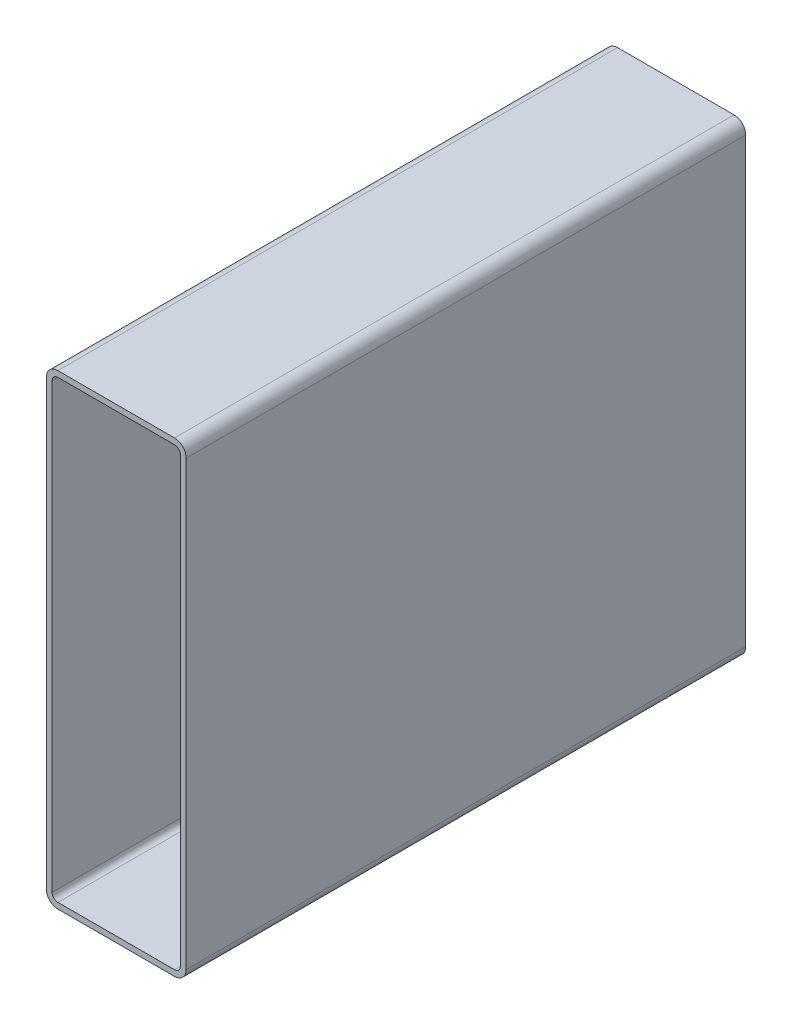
ISO-10303-21;
HEADER;
FILE_DESCRIPTION(('STEP AP214'),'2;1');
FILE_NAME('part.step','',(''),(''),'','','');
FILE_SCHEMA(('AUTOMOTIVE_DESIGN { 1 0 10303 214 1 1 1 1 }'));
ENDSEC;
DATA;
#1=APPLICATION_CONTEXT('core data for automotive mechanical design processes');
#2=APPLICATION_PROTOCOL_DEFINITION('international standard','automotive_design',2000,#1);
#3=PRODUCT_CONTEXT('',#1,'mechanical');
#4=PRODUCT('Part','Part','',(#3));
#5=PRODUCT_RELATED_PRODUCT_CATEGORY('part','',(#4));
#6=PRODUCT_DEFINITION_FORMATION('','',#4);
#7=PRODUCT_DEFINITION_CONTEXT('part definition',#1,'design');
#8=PRODUCT_DEFINITION('design','',#6,#7);
#9=PRODUCT_DEFINITION_SHAPE('','',#8);
#10=(LENGTH_UNIT() NAMED_UNIT(*) SI_UNIT(.MILLI.,.METRE.));
#11=(NAMED_UNIT(*) PLANE_ANGLE_UNIT() SI_UNIT($,.RADIAN.));
#12=(NAMED_UNIT(*) SI_UNIT($,.STERADIAN.) SOLID_ANGLE_UNIT());
#13=UNCERTAINTY_MEASURE_WITH_UNIT(LENGTH_MEASURE(1.E-05),#10,'distance_accuracy_value','');
#14=(GEOMETRIC_REPRESENTATION_CONTEXT(3) GLOBAL_UNCERTAINTY_ASSIGNED_CONTEXT((#13)) GLOBAL_UNIT_ASSIGNED_CONTEXT((#10,
#11,#12)) REPRESENTATION_CONTEXT('',''));
#15=CARTESIAN_POINT('',(0.,0.,0.));
#16=DIRECTION('',(0.,0.,1.));
#17=DIRECTION('',(1.,0.,0.));
#18=AXIS2_PLACEMENT_3D('',#15,#16,#17);
#19=CARTESIAN_POINT('',(8.83911603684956,249.570313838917,304.8));
#20=DIRECTION('',(0.,0.,1.));
#21=DIRECTION('',(1.,0.,0.));
#22=AXIS2_PLACEMENT_3D('',#19,#20,#21);
#23=PLANE('',#22);
#24=CARTESIAN_POINT('',(8.83911603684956,249.570313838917,304.8));
#25=DIRECTION('',(0.,0.,1.));
#26=DIRECTION('',(1.,0.,0.));
#27=AXIS2_PLACEMENT_3D('',#24,#25,#26);
#28=CIRCLE('',#27,6.35000000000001);
#29=CARTESIAN_POINT('',(8.83911603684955,255.920313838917,304.8));
#30=VERTEX_POINT('',#29);
#31=CARTESIAN_POINT('',(2.48911603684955,249.570313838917,304.8));
#32=VERTEX_POINT('',#31);
#33=EDGE_CURVE('E211',#30,#32,#28,.T.);
#34=ORIENTED_EDGE('',*,*,#33,.T.);
#35=DIRECTION('',(0.,-1.,0.));
#36=VECTOR('',#35,1.);
#37=CARTESIAN_POINT('',(2.48911603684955,8.27031383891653,304.8));
#38=LINE('',#37,#36);
#39=CARTESIAN_POINT('',(2.48911603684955,8.27031383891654,304.8));
#40=VERTEX_POINT('',#39);
#41=EDGE_CURVE('E214',#32,#40,#38,.T.);
#42=ORIENTED_EDGE('',*,*,#41,.T.);
#43=CARTESIAN_POINT('',(8.83911603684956,8.27031383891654,304.8));
#44=DIRECTION('',(0.,0.,1.));
#45=DIRECTION('',(1.,0.,0.));
#46=AXIS2_PLACEMENT_3D('',#43,#44,#45);
#47=CIRCLE('',#46,6.35);
#48=CARTESIAN_POINT('',(8.83911603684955,1.92031383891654,304.8));
#49=VERTEX_POINT('',#48);
#50=EDGE_CURVE('E217',#40,#49,#47,.T.);
#51=ORIENTED_EDGE('',*,*,#50,.T.);
#52=DIRECTION('',(1.,0.,0.));
#53=VECTOR('',#52,1.);
#54=CARTESIAN_POINT('',(72.3391160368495,1.92031383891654,304.8));
#55=LINE('',#54,#53);
#56=CARTESIAN_POINT('',(72.3391160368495,1.92031383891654,304.8));
#57=VERTEX_POINT('',#56);
#58=EDGE_CURVE('E219',#49,#57,#55,.T.);
#59=ORIENTED_EDGE('',*,*,#58,.T.);
#60=CARTESIAN_POINT('',(72.3391160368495,8.27031383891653,304.8));
#61=DIRECTION('',(0.,0.,1.));
#62=DIRECTION('',(1.,0.,0.));
#63=AXIS2_PLACEMENT_3D('',#60,#61,#62);
#64=CIRCLE('',#63,6.35);
#65=CARTESIAN_POINT('',(78.6891160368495,8.27031383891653,304.8));
#66=VERTEX_POINT('',#65);
#67=EDGE_CURVE('E221',#57,#66,#64,.T.);
#68=ORIENTED_EDGE('',*,*,#67,.T.);
#69=DIRECTION('',(0.,1.,0.));
#70=VECTOR('',#69,1.);
#71=CARTESIAN_POINT('',(78.6891160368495,249.570313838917,304.8));
#72=LINE('',#71,#70);
#73=CARTESIAN_POINT('',(78.6891160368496,249.570313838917,304.8));
#74=VERTEX_POINT('',#73);
#75=EDGE_CURVE('E223',#66,#74,#72,.T.);
#76=ORIENTED_EDGE('',*,*,#75,.T.);
#77=CARTESIAN_POINT('',(72.3391160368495,249.570313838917,304.8));
#78=DIRECTION('',(0.,0.,1.));
#79=DIRECTION('',(1.,0.,0.));
#80=AXIS2_PLACEMENT_3D('',#77,#78,#79);
#81=CIRCLE('',#80,6.35000000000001);
#82=CARTESIAN_POINT('',(72.3391160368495,255.920313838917,304.8));
#83=VERTEX_POINT('',#82);
#84=EDGE_CURVE('E225',#74,#83,#81,.T.);
#85=ORIENTED_EDGE('',*,*,#84,.T.);
#86=DIRECTION('',(-1.,0.,0.));
#87=VECTOR('',#86,1.);
#88=CARTESIAN_POINT('',(8.83911603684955,255.920313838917,304.8));
#89=LINE('',#88,#87);
#90=EDGE_CURVE('E227',#83,#30,#89,.T.);
#91=ORIENTED_EDGE('',*,*,#90,.T.);
#92=EDGE_LOOP('',(#34,#42,#51,#59,#68,#76,#85,#91));
#93=FACE_BOUND('',#92,.T.);
#94=DIRECTION('',(0.,-1.,0.));
#95=VECTOR('',#94,1.);
#96=CARTESIAN_POINT('',(5.66411603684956,8.27031383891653,304.8));
#97=LINE('',#96,#95);
#98=CARTESIAN_POINT('',(5.66411603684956,249.570313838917,304.8));
#99=VERTEX_POINT('',#98);
#100=CARTESIAN_POINT('',(5.66411603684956,8.27031383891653,304.8));
#101=VERTEX_POINT('',#100);
#102=EDGE_CURVE('E154',#99,#101,#97,.T.);
#103=ORIENTED_EDGE('',*,*,#102,.F.);
#104=CARTESIAN_POINT('',(8.83911603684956,249.570313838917,304.8));
#105=DIRECTION('',(0.,0.,1.));
#106=DIRECTION('',(1.,0.,0.));
#107=AXIS2_PLACEMENT_3D('',#104,#105,#106);
#108=CIRCLE('',#107,3.17499999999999);
#109=CARTESIAN_POINT('',(8.83911603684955,252.745313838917,304.8));
#110=VERTEX_POINT('',#109);
#111=EDGE_CURVE('E146',#110,#99,#108,.T.);
#112=ORIENTED_EDGE('',*,*,#111,.F.);
#113=DIRECTION('',(-1.,0.,0.));
#114=VECTOR('',#113,1.);
#115=CARTESIAN_POINT('',(8.83911603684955,252.745313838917,304.8));
#116=LINE('',#115,#114);
#117=CARTESIAN_POINT('',(72.3391160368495,252.745313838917,304.8));
#118=VERTEX_POINT('',#117);
#119=EDGE_CURVE('E179',#118,#110,#116,.T.);
#120=ORIENTED_EDGE('',*,*,#119,.F.);
#121=CARTESIAN_POINT('',(72.3391160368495,249.570313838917,304.8));
#122=DIRECTION('',(0.,0.,1.));
#123=DIRECTION('',(1.,0.,0.));
#124=AXIS2_PLACEMENT_3D('',#121,#122,#123);
#125=CIRCLE('',#124,3.175);
#126=CARTESIAN_POINT('',(75.5141160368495,249.570313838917,304.8));
#127=VERTEX_POINT('',#126);
#128=EDGE_CURVE('E177',#127,#118,#125,.T.);
#129=ORIENTED_EDGE('',*,*,#128,.F.);
#130=DIRECTION('',(0.,1.,0.));
#131=VECTOR('',#130,1.);
#132=CARTESIAN_POINT('',(75.5141160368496,249.570313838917,304.8));
#133=LINE('',#132,#131);
#134=CARTESIAN_POINT('',(75.5141160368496,8.27031383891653,304.8));
#135=VERTEX_POINT('',#134);
#136=EDGE_CURVE('E175',#135,#127,#133,.T.);
#137=ORIENTED_EDGE('',*,*,#136,.F.);
#138=CARTESIAN_POINT('',(72.3391160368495,8.27031383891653,304.8));
#139=DIRECTION('',(0.,0.,1.));
#140=DIRECTION('',(1.,0.,0.));
#141=AXIS2_PLACEMENT_3D('',#138,#139,#140);
#142=CIRCLE('',#141,3.175);
#143=CARTESIAN_POINT('',(72.3391160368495,5.09531383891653,304.8));
#144=VERTEX_POINT('',#143);
#145=EDGE_CURVE('E173',#144,#135,#142,.T.);
#146=ORIENTED_EDGE('',*,*,#145,.F.);
#147=DIRECTION('',(1.,0.,0.));
#148=VECTOR('',#147,1.);
#149=CARTESIAN_POINT('',(72.3391160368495,5.09531383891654,304.8));
#150=LINE('',#149,#148);
#151=CARTESIAN_POINT('',(8.83911603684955,5.09531383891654,304.8));
#152=VERTEX_POINT('',#151);
#153=EDGE_CURVE('E169',#152,#144,#150,.T.);
#154=ORIENTED_EDGE('',*,*,#153,.F.);
#155=CARTESIAN_POINT('',(8.83911603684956,8.27031383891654,304.8));
#156=DIRECTION('',(0.,0.,1.));
#157=DIRECTION('',(1.,0.,0.));
#158=AXIS2_PLACEMENT_3D('',#155,#156,#157);
#159=CIRCLE('',#158,3.175);
#160=EDGE_CURVE('E167',#101,#152,#159,.T.);
#161=ORIENTED_EDGE('',*,*,#160,.F.);
#162=EDGE_LOOP('',(#103,#112,#120,#129,#137,#146,#154,#161));
#163=FACE_BOUND('',#162,.T.);
#164=ADVANCED_FACE('F33',(#93,#163),#23,.T.);
#165=CARTESIAN_POINT('',(8.83911603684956,249.570313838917,0.));
#166=DIRECTION('',(0.,0.,1.));
#167=DIRECTION('',(1.,0.,0.));
#168=AXIS2_PLACEMENT_3D('',#165,#166,#167);
#169=PLANE('',#168);
#170=CARTESIAN_POINT('',(8.83911603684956,249.570313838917,0.));
#171=DIRECTION('',(0.,0.,1.));
#172=DIRECTION('',(1.,0.,0.));
#173=AXIS2_PLACEMENT_3D('',#170,#171,#172);
#174=CIRCLE('',#173,6.35000000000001);
#175=CARTESIAN_POINT('',(8.83911603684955,255.920313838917,0.));
#176=VERTEX_POINT('',#175);
#177=CARTESIAN_POINT('',(2.48911603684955,249.570313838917,0.));
#178=VERTEX_POINT('',#177);
#179=EDGE_CURVE('E162',#176,#178,#174,.T.);
#180=ORIENTED_EDGE('',*,*,#179,.F.);
#181=DIRECTION('',(-1.,0.,0.));
#182=VECTOR('',#181,1.);
#183=CARTESIAN_POINT('',(8.83911603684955,255.920313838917,0.));
#184=LINE('',#183,#182);
#185=CARTESIAN_POINT('',(72.3391160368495,255.920313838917,0.));
#186=VERTEX_POINT('',#185);
#187=EDGE_CURVE('E215',#186,#176,#184,.T.);
#188=ORIENTED_EDGE('',*,*,#187,.F.);
#189=CARTESIAN_POINT('',(72.3391160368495,249.570313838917,0.));
#190=DIRECTION('',(0.,0.,1.));
#191=DIRECTION('',(1.,0.,0.));
#192=AXIS2_PLACEMENT_3D('',#189,#190,#191);
#193=CIRCLE('',#192,6.35000000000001);
#194=CARTESIAN_POINT('',(78.6891160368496,249.570313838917,0.));
#195=VERTEX_POINT('',#194);
#196=EDGE_CURVE('E242',#195,#186,#193,.T.);
#197=ORIENTED_EDGE('',*,*,#196,.F.);
#198=DIRECTION('',(0.,1.,0.));
#199=VECTOR('',#198,1.);
#200=CARTESIAN_POINT('',(78.6891160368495,249.570313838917,0.));
#201=LINE('',#200,#199);
#202=CARTESIAN_POINT('',(78.6891160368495,8.27031383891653,0.));
#203=VERTEX_POINT('',#202);
#204=EDGE_CURVE('E240',#203,#195,#201,.T.);
#205=ORIENTED_EDGE('',*,*,#204,.F.);
#206=CARTESIAN_POINT('',(72.3391160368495,8.27031383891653,0.));
#207=DIRECTION('',(0.,0.,1.));
#208=DIRECTION('',(1.,0.,0.));
#209=AXIS2_PLACEMENT_3D('',#206,#207,#208);
#210=CIRCLE('',#209,6.35);
#211=CARTESIAN_POINT('',(72.3391160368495,1.92031383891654,0.));
#212=VERTEX_POINT('',#211);
#213=EDGE_CURVE('E238',#212,#203,#210,.T.);
#214=ORIENTED_EDGE('',*,*,#213,.F.);
#215=DIRECTION('',(1.,0.,0.));
#216=VECTOR('',#215,1.);
#217=CARTESIAN_POINT('',(72.3391160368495,1.92031383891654,0.));
#218=LINE('',#217,#216);
#219=CARTESIAN_POINT('',(8.83911603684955,1.92031383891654,0.));
#220=VERTEX_POINT('',#219);
#221=EDGE_CURVE('E236',#220,#212,#218,.T.);
#222=ORIENTED_EDGE('',*,*,#221,.F.);
#223=CARTESIAN_POINT('',(8.83911603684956,8.27031383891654,0.));
#224=DIRECTION('',(0.,0.,1.));
#225=DIRECTION('',(1.,0.,0.));
#226=AXIS2_PLACEMENT_3D('',#223,#224,#225);
#227=CIRCLE('',#226,6.35);
#228=CARTESIAN_POINT('',(2.48911603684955,8.27031383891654,0.));
#229=VERTEX_POINT('',#228);
#230=EDGE_CURVE('E234',#229,#220,#227,.T.);
#231=ORIENTED_EDGE('',*,*,#230,.F.);
#232=DIRECTION('',(0.,-1.,0.));
#233=VECTOR('',#232,1.);
#234=CARTESIAN_POINT('',(2.48911603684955,8.27031383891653,0.));
#235=LINE('',#234,#233);
#236=EDGE_CURVE('E232',#178,#229,#235,.T.);
#237=ORIENTED_EDGE('',*,*,#236,.F.);
#238=EDGE_LOOP('',(#180,#188,#197,#205,#214,#222,#231,#237));
#239=FACE_BOUND('',#238,.T.);
#240=CARTESIAN_POINT('',(8.83911603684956,249.570313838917,0.));
#241=DIRECTION('',(0.,0.,1.));
#242=DIRECTION('',(1.,0.,0.));
#243=AXIS2_PLACEMENT_3D('',#240,#241,#242);
#244=CIRCLE('',#243,3.17499999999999);
#245=CARTESIAN_POINT('',(8.83911603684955,252.745313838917,0.));
#246=VERTEX_POINT('',#245);
#247=CARTESIAN_POINT('',(5.66411603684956,249.570313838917,0.));
#248=VERTEX_POINT('',#247);
#249=EDGE_CURVE('E56',#246,#248,#244,.T.);
#250=ORIENTED_EDGE('',*,*,#249,.T.);
#251=DIRECTION('',(0.,-1.,0.));
#252=VECTOR('',#251,1.);
#253=CARTESIAN_POINT('',(5.66411603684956,8.27031383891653,0.));
#254=LINE('',#253,#252);
#255=CARTESIAN_POINT('',(5.66411603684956,8.27031383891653,0.));
#256=VERTEX_POINT('',#255);
#257=EDGE_CURVE('E161',#248,#256,#254,.T.);
#258=ORIENTED_EDGE('',*,*,#257,.T.);
#259=CARTESIAN_POINT('',(8.83911603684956,8.27031383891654,0.));
#260=DIRECTION('',(0.,0.,1.));
#261=DIRECTION('',(1.,0.,0.));
#262=AXIS2_PLACEMENT_3D('',#259,#260,#261);
#263=CIRCLE('',#262,3.175);
#264=CARTESIAN_POINT('',(8.83911603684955,5.09531383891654,0.));
#265=VERTEX_POINT('',#264);
#266=EDGE_CURVE('E183',#256,#265,#263,.T.);
#267=ORIENTED_EDGE('',*,*,#266,.T.);
#268=DIRECTION('',(1.,0.,0.));
#269=VECTOR('',#268,1.);
#270=CARTESIAN_POINT('',(72.3391160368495,5.09531383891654,0.));
#271=LINE('',#270,#269);
#272=CARTESIAN_POINT('',(72.3391160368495,5.09531383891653,0.));
#273=VERTEX_POINT('',#272);
#274=EDGE_CURVE('E186',#265,#273,#271,.T.);
#275=ORIENTED_EDGE('',*,*,#274,.T.);
#276=CARTESIAN_POINT('',(72.3391160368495,8.27031383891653,0.));
#277=DIRECTION('',(0.,0.,1.));
#278=DIRECTION('',(1.,0.,0.));
#279=AXIS2_PLACEMENT_3D('',#276,#277,#278);
#280=CIRCLE('',#279,3.175);
#281=CARTESIAN_POINT('',(75.5141160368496,8.27031383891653,0.));
#282=VERTEX_POINT('',#281);
#283=EDGE_CURVE('E189',#273,#282,#280,.T.);
#284=ORIENTED_EDGE('',*,*,#283,.T.);
#285=DIRECTION('',(0.,1.,0.));
#286=VECTOR('',#285,1.);
#287=CARTESIAN_POINT('',(75.5141160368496,249.570313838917,0.));
#288=LINE('',#287,#286);
#289=CARTESIAN_POINT('',(75.5141160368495,249.570313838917,0.));
#290=VERTEX_POINT('',#289);
#291=EDGE_CURVE('E192',#282,#290,#288,.T.);
#292=ORIENTED_EDGE('',*,*,#291,.T.);
#293=CARTESIAN_POINT('',(72.3391160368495,249.570313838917,0.));
#294=DIRECTION('',(0.,0.,1.));
#295=DIRECTION('',(1.,0.,0.));
#296=AXIS2_PLACEMENT_3D('',#293,#294,#295);
#297=CIRCLE('',#296,3.175);
#298=CARTESIAN_POINT('',(72.3391160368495,252.745313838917,0.));
#299=VERTEX_POINT('',#298);
#300=EDGE_CURVE('E195',#290,#299,#297,.T.);
#301=ORIENTED_EDGE('',*,*,#300,.T.);
#302=DIRECTION('',(-1.,0.,0.));
#303=VECTOR('',#302,1.);
#304=CARTESIAN_POINT('',(8.83911603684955,252.745313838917,0.));
#305=LINE('',#304,#303);
#306=EDGE_CURVE('E155',#299,#246,#305,.T.);
#307=ORIENTED_EDGE('',*,*,#306,.T.);
#308=EDGE_LOOP('',(#250,#258,#267,#275,#284,#292,#301,#307));
#309=FACE_BOUND('',#308,.T.);
#310=ADVANCED_FACE('F272',(#239,#309),#169,.F.);
#311=CARTESIAN_POINT('',(8.83911603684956,249.570313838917,304.8));
#312=DIRECTION('',(0.,0.,-1.));
#313=DIRECTION('',(-1.,0.,0.));
#314=AXIS2_PLACEMENT_3D('',#311,#312,#313);
#315=CYLINDRICAL_SURFACE('',#314,6.35000000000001);
#316=ORIENTED_EDGE('',*,*,#179,.T.);
#317=DIRECTION('',(0.,0.,-1.));
#318=VECTOR('',#317,1.);
#319=CARTESIAN_POINT('',(2.48911603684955,249.570313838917,304.8));
#320=LINE('',#319,#318);
#321=EDGE_CURVE('E11',#32,#178,#320,.T.);
#322=ORIENTED_EDGE('',*,*,#321,.F.);
#323=ORIENTED_EDGE('',*,*,#33,.F.);
#324=DIRECTION('',(0.,0.,-1.));
#325=VECTOR('',#324,1.);
#326=CARTESIAN_POINT('',(8.83911603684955,255.920313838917,304.8));
#327=LINE('',#326,#325);
#328=EDGE_CURVE('E229',#30,#176,#327,.T.);
#329=ORIENTED_EDGE('',*,*,#328,.T.);
#330=EDGE_LOOP('',(#316,#322,#323,#329));
#331=FACE_BOUND('',#330,.T.);
#332=ADVANCED_FACE('F35',(#331),#315,.T.);
#333=CARTESIAN_POINT('',(2.48911603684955,8.27031383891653,304.8));
#334=DIRECTION('',(1.,0.,0.));
#335=DIRECTION('',(0.,0.,-1.));
#336=AXIS2_PLACEMENT_3D('',#333,#334,#335);
#337=PLANE('',#336);
#338=ORIENTED_EDGE('',*,*,#236,.T.);
#339=DIRECTION('',(0.,0.,-1.));
#340=VECTOR('',#339,1.);
#341=CARTESIAN_POINT('',(2.48911603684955,8.27031383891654,304.8));
#342=LINE('',#341,#340);
#343=EDGE_CURVE('E41',#40,#229,#342,.T.);
#344=ORIENTED_EDGE('',*,*,#343,.F.);
#345=ORIENTED_EDGE('',*,*,#41,.F.);
#346=ORIENTED_EDGE('',*,*,#321,.T.);
#347=EDGE_LOOP('',(#338,#344,#345,#346));
#348=FACE_BOUND('',#347,.T.);
#349=ADVANCED_FACE('F289',(#348),#337,.F.);
#350=CARTESIAN_POINT('',(8.83911603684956,8.27031383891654,304.8));
#351=DIRECTION('',(0.,0.,-1.));
#352=DIRECTION('',(-1.,0.,0.));
#353=AXIS2_PLACEMENT_3D('',#350,#351,#352);
#354=CYLINDRICAL_SURFACE('',#353,6.35);
#355=ORIENTED_EDGE('',*,*,#230,.T.);
#356=DIRECTION('',(0.,0.,-1.));
#357=VECTOR('',#356,1.);
#358=CARTESIAN_POINT('',(8.83911603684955,1.92031383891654,304.8));
#359=LINE('',#358,#357);
#360=EDGE_CURVE('E259',#49,#220,#359,.T.);
#361=ORIENTED_EDGE('',*,*,#360,.F.);
#362=ORIENTED_EDGE('',*,*,#50,.F.);
#363=ORIENTED_EDGE('',*,*,#343,.T.);
#364=EDGE_LOOP('',(#355,#361,#362,#363));
#365=FACE_BOUND('',#364,.T.);
#366=ADVANCED_FACE('F266',(#365),#354,.T.);
#367=CARTESIAN_POINT('',(72.3391160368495,1.92031383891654,304.8));
#368=DIRECTION('',(0.,1.,0.));
#369=DIRECTION('',(0.,0.,1.));
#370=AXIS2_PLACEMENT_3D('',#367,#368,#369);
#371=PLANE('',#370);
#372=ORIENTED_EDGE('',*,*,#221,.T.);
#373=DIRECTION('',(0.,0.,-1.));
#374=VECTOR('',#373,1.);
#375=CARTESIAN_POINT('',(72.3391160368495,1.92031383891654,304.8));
#376=LINE('',#375,#374);
#377=EDGE_CURVE('E256',#57,#212,#376,.T.);
#378=ORIENTED_EDGE('',*,*,#377,.F.);
#379=ORIENTED_EDGE('',*,*,#58,.F.);
#380=ORIENTED_EDGE('',*,*,#360,.T.);
#381=EDGE_LOOP('',(#372,#378,#379,#380));
#382=FACE_BOUND('',#381,.T.);
#383=ADVANCED_FACE('F278',(#382),#371,.F.);
#384=CARTESIAN_POINT('',(72.3391160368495,8.27031383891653,304.8));
#385=DIRECTION('',(0.,0.,-1.));
#386=DIRECTION('',(-1.,0.,0.));
#387=AXIS2_PLACEMENT_3D('',#384,#385,#386);
#388=CYLINDRICAL_SURFACE('',#387,6.35);
#389=ORIENTED_EDGE('',*,*,#213,.T.);
#390=DIRECTION('',(0.,0.,-1.));
#391=VECTOR('',#390,1.);
#392=CARTESIAN_POINT('',(78.6891160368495,8.27031383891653,304.8));
#393=LINE('',#392,#391);
#394=EDGE_CURVE('E253',#66,#203,#393,.T.);
#395=ORIENTED_EDGE('',*,*,#394,.F.);
#396=ORIENTED_EDGE('',*,*,#67,.F.);
#397=ORIENTED_EDGE('',*,*,#377,.T.);
#398=EDGE_LOOP('',(#389,#395,#396,#397));
#399=FACE_BOUND('',#398,.T.);
#400=ADVANCED_FACE('F282',(#399),#388,.T.);
#401=CARTESIAN_POINT('',(78.6891160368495,249.570313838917,304.8));
#402=DIRECTION('',(-1.,0.,0.));
#403=DIRECTION('',(0.,0.,1.));
#404=AXIS2_PLACEMENT_3D('',#401,#402,#403);
#405=PLANE('',#404);
#406=ORIENTED_EDGE('',*,*,#204,.T.);
#407=DIRECTION('',(0.,0.,-1.));
#408=VECTOR('',#407,1.);
#409=CARTESIAN_POINT('',(78.6891160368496,249.570313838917,304.8));
#410=LINE('',#409,#408);
#411=EDGE_CURVE('E250',#74,#195,#410,.T.);
#412=ORIENTED_EDGE('',*,*,#411,.F.);
#413=ORIENTED_EDGE('',*,*,#75,.F.);
#414=ORIENTED_EDGE('',*,*,#394,.T.);
#415=EDGE_LOOP('',(#406,#412,#413,#414));
#416=FACE_BOUND('',#415,.T.);
#417=ADVANCED_FACE('F302',(#416),#405,.F.);
#418=CARTESIAN_POINT('',(72.3391160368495,249.570313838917,304.8));
#419=DIRECTION('',(0.,0.,-1.));
#420=DIRECTION('',(-1.,0.,0.));
#421=AXIS2_PLACEMENT_3D('',#418,#419,#420);
#422=CYLINDRICAL_SURFACE('',#421,6.35000000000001);
#423=ORIENTED_EDGE('',*,*,#196,.T.);
#424=DIRECTION('',(0.,0.,-1.));
#425=VECTOR('',#424,1.);
#426=CARTESIAN_POINT('',(72.3391160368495,255.920313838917,304.8));
#427=LINE('',#426,#425);
#428=EDGE_CURVE('E247',#83,#186,#427,.T.);
#429=ORIENTED_EDGE('',*,*,#428,.F.);
#430=ORIENTED_EDGE('',*,*,#84,.F.);
#431=ORIENTED_EDGE('',*,*,#411,.T.);
#432=EDGE_LOOP('',(#423,#429,#430,#431));
#433=FACE_BOUND('',#432,.T.);
#434=ADVANCED_FACE('F300',(#433),#422,.T.);
#435=CARTESIAN_POINT('',(8.83911603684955,255.920313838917,304.8));
#436=DIRECTION('',(0.,-1.,0.));
#437=DIRECTION('',(0.,0.,-1.));
#438=AXIS2_PLACEMENT_3D('',#435,#436,#437);
#439=PLANE('',#438);
#440=ORIENTED_EDGE('',*,*,#187,.T.);
#441=ORIENTED_EDGE('',*,*,#328,.F.);
#442=ORIENTED_EDGE('',*,*,#90,.F.);
#443=ORIENTED_EDGE('',*,*,#428,.T.);
#444=EDGE_LOOP('',(#440,#441,#442,#443));
#445=FACE_BOUND('',#444,.T.);
#446=ADVANCED_FACE('F295',(#445),#439,.F.);
#447=CARTESIAN_POINT('',(8.83911603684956,249.570313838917,304.8));
#448=DIRECTION('',(0.,0.,-1.));
#449=DIRECTION('',(-1.,0.,0.));
#450=AXIS2_PLACEMENT_3D('',#447,#448,#449);
#451=CYLINDRICAL_SURFACE('',#450,3.17499999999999);
#452=ORIENTED_EDGE('',*,*,#249,.F.);
#453=DIRECTION('',(0.,0.,-1.));
#454=VECTOR('',#453,1.);
#455=CARTESIAN_POINT('',(8.83911603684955,252.745313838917,304.8));
#456=LINE('',#455,#454);
#457=EDGE_CURVE('E150',#110,#246,#456,.T.);
#458=ORIENTED_EDGE('',*,*,#457,.F.);
#459=ORIENTED_EDGE('',*,*,#111,.T.);
#460=DIRECTION('',(0.,0.,-1.));
#461=VECTOR('',#460,1.);
#462=CARTESIAN_POINT('',(5.66411603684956,249.570313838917,304.8));
#463=LINE('',#462,#461);
#464=EDGE_CURVE('E149',#99,#248,#463,.T.);
#465=ORIENTED_EDGE('',*,*,#464,.T.);
#466=EDGE_LOOP('',(#452,#458,#459,#465));
#467=FACE_BOUND('',#466,.T.);
#468=ADVANCED_FACE('F148',(#467),#451,.F.);
#469=CARTESIAN_POINT('',(5.66411603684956,8.27031383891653,304.8));
#470=DIRECTION('',(1.,0.,0.));
#471=DIRECTION('',(0.,0.,-1.));
#472=AXIS2_PLACEMENT_3D('',#469,#470,#471);
#473=PLANE('',#472);
#474=ORIENTED_EDGE('',*,*,#257,.F.);
#475=ORIENTED_EDGE('',*,*,#464,.F.);
#476=ORIENTED_EDGE('',*,*,#102,.T.);
#477=DIRECTION('',(0.,0.,-1.));
#478=VECTOR('',#477,1.);
#479=CARTESIAN_POINT('',(5.66411603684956,8.27031383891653,304.8));
#480=LINE('',#479,#478);
#481=EDGE_CURVE('E163',#101,#256,#480,.T.);
#482=ORIENTED_EDGE('',*,*,#481,.T.);
#483=EDGE_LOOP('',(#474,#475,#476,#482));
#484=FACE_BOUND('',#483,.T.);
#485=ADVANCED_FACE('F158',(#484),#473,.T.);
#486=CARTESIAN_POINT('',(8.83911603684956,8.27031383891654,304.8));
#487=DIRECTION('',(0.,0.,-1.));
#488=DIRECTION('',(-1.,0.,0.));
#489=AXIS2_PLACEMENT_3D('',#486,#487,#488);
#490=CYLINDRICAL_SURFACE('',#489,3.175);
#491=ORIENTED_EDGE('',*,*,#266,.F.);
#492=ORIENTED_EDGE('',*,*,#481,.F.);
#493=ORIENTED_EDGE('',*,*,#160,.T.);
#494=DIRECTION('',(0.,0.,-1.));
#495=VECTOR('',#494,1.);
#496=CARTESIAN_POINT('',(8.83911603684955,5.09531383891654,304.8));
#497=LINE('',#496,#495);
#498=EDGE_CURVE('E208',#152,#265,#497,.T.);
#499=ORIENTED_EDGE('',*,*,#498,.T.);
#500=EDGE_LOOP('',(#491,#492,#493,#499));
#501=FACE_BOUND('',#500,.T.);
#502=ADVANCED_FACE('F327',(#501),#490,.F.);
#503=CARTESIAN_POINT('',(72.3391160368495,5.09531383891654,304.8));
#504=DIRECTION('',(0.,1.,0.));
#505=DIRECTION('',(0.,0.,1.));
#506=AXIS2_PLACEMENT_3D('',#503,#504,#505);
#507=PLANE('',#506);
#508=ORIENTED_EDGE('',*,*,#274,.F.);
#509=ORIENTED_EDGE('',*,*,#498,.F.);
#510=ORIENTED_EDGE('',*,*,#153,.T.);
#511=DIRECTION('',(0.,0.,-1.));
#512=VECTOR('',#511,1.);
#513=CARTESIAN_POINT('',(72.3391160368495,5.09531383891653,304.8));
#514=LINE('',#513,#512);
#515=EDGE_CURVE('E206',#144,#273,#514,.T.);
#516=ORIENTED_EDGE('',*,*,#515,.T.);
#517=EDGE_LOOP('',(#508,#509,#510,#516));
#518=FACE_BOUND('',#517,.T.);
#519=ADVANCED_FACE('F331',(#518),#507,.T.);
#520=CARTESIAN_POINT('',(72.3391160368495,8.27031383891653,304.8));
#521=DIRECTION('',(0.,0.,-1.));
#522=DIRECTION('',(-1.,0.,0.));
#523=AXIS2_PLACEMENT_3D('',#520,#521,#522);
#524=CYLINDRICAL_SURFACE('',#523,3.175);
#525=ORIENTED_EDGE('',*,*,#283,.F.);
#526=ORIENTED_EDGE('',*,*,#515,.F.);
#527=ORIENTED_EDGE('',*,*,#145,.T.);
#528=DIRECTION('',(0.,0.,-1.));
#529=VECTOR('',#528,1.);
#530=CARTESIAN_POINT('',(75.5141160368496,8.27031383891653,304.8));
#531=LINE('',#530,#529);
#532=EDGE_CURVE('E204',#135,#282,#531,.T.);
#533=ORIENTED_EDGE('',*,*,#532,.T.);
#534=EDGE_LOOP('',(#525,#526,#527,#533));
#535=FACE_BOUND('',#534,.T.);
#536=ADVANCED_FACE('F337',(#535),#524,.F.);
#537=CARTESIAN_POINT('',(75.5141160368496,249.570313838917,304.8));
#538=DIRECTION('',(-1.,0.,0.));
#539=DIRECTION('',(0.,0.,1.));
#540=AXIS2_PLACEMENT_3D('',#537,#538,#539);
#541=PLANE('',#540);
#542=ORIENTED_EDGE('',*,*,#291,.F.);
#543=ORIENTED_EDGE('',*,*,#532,.F.);
#544=ORIENTED_EDGE('',*,*,#136,.T.);
#545=DIRECTION('',(0.,0.,-1.));
#546=VECTOR('',#545,1.);
#547=CARTESIAN_POINT('',(75.5141160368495,249.570313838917,304.8));
#548=LINE('',#547,#546);
#549=EDGE_CURVE('E202',#127,#290,#548,.T.);
#550=ORIENTED_EDGE('',*,*,#549,.T.);
#551=EDGE_LOOP('',(#542,#543,#544,#550));
#552=FACE_BOUND('',#551,.T.);
#553=ADVANCED_FACE('F341',(#552),#541,.T.);
#554=CARTESIAN_POINT('',(72.3391160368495,249.570313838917,304.8));
#555=DIRECTION('',(0.,0.,-1.));
#556=DIRECTION('',(-1.,0.,0.));
#557=AXIS2_PLACEMENT_3D('',#554,#555,#556);
#558=CYLINDRICAL_SURFACE('',#557,3.175);
#559=ORIENTED_EDGE('',*,*,#300,.F.);
#560=ORIENTED_EDGE('',*,*,#549,.F.);
#561=ORIENTED_EDGE('',*,*,#128,.T.);
#562=DIRECTION('',(0.,0.,-1.));
#563=VECTOR('',#562,1.);
#564=CARTESIAN_POINT('',(72.3391160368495,252.745313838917,304.8));
#565=LINE('',#564,#563);
#566=EDGE_CURVE('E48',#118,#299,#565,.T.);
#567=ORIENTED_EDGE('',*,*,#566,.T.);
#568=EDGE_LOOP('',(#559,#560,#561,#567));
#569=FACE_BOUND('',#568,.T.);
#570=ADVANCED_FACE('F345',(#569),#558,.F.);
#571=CARTESIAN_POINT('',(8.83911603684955,252.745313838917,304.8));
#572=DIRECTION('',(0.,-1.,0.));
#573=DIRECTION('',(0.,0.,-1.));
#574=AXIS2_PLACEMENT_3D('',#571,#572,#573);
#575=PLANE('',#574);
#576=ORIENTED_EDGE('',*,*,#306,.F.);
#577=ORIENTED_EDGE('',*,*,#566,.F.);
#578=ORIENTED_EDGE('',*,*,#119,.T.);
#579=ORIENTED_EDGE('',*,*,#457,.T.);
#580=EDGE_LOOP('',(#576,#577,#578,#579));
#581=FACE_BOUND('',#580,.T.);
#582=ADVANCED_FACE('F349',(#581),#575,.T.);
#583=CLOSED_SHELL('',(#164,#310,#332,#349,#366,#383,#400,#417,#434,#446,#468,#485,#502,#519,
#536,#553,#570,#582));
#584=MANIFOLD_SOLID_BREP('B2',#583);
#585=ADVANCED_BREP_SHAPE_REPRESENTATION('',(#18,#584),#14);
#586=SHAPE_DEFINITION_REPRESENTATION(#9,#585);
ENDSEC;
END-ISO-10303-21;
